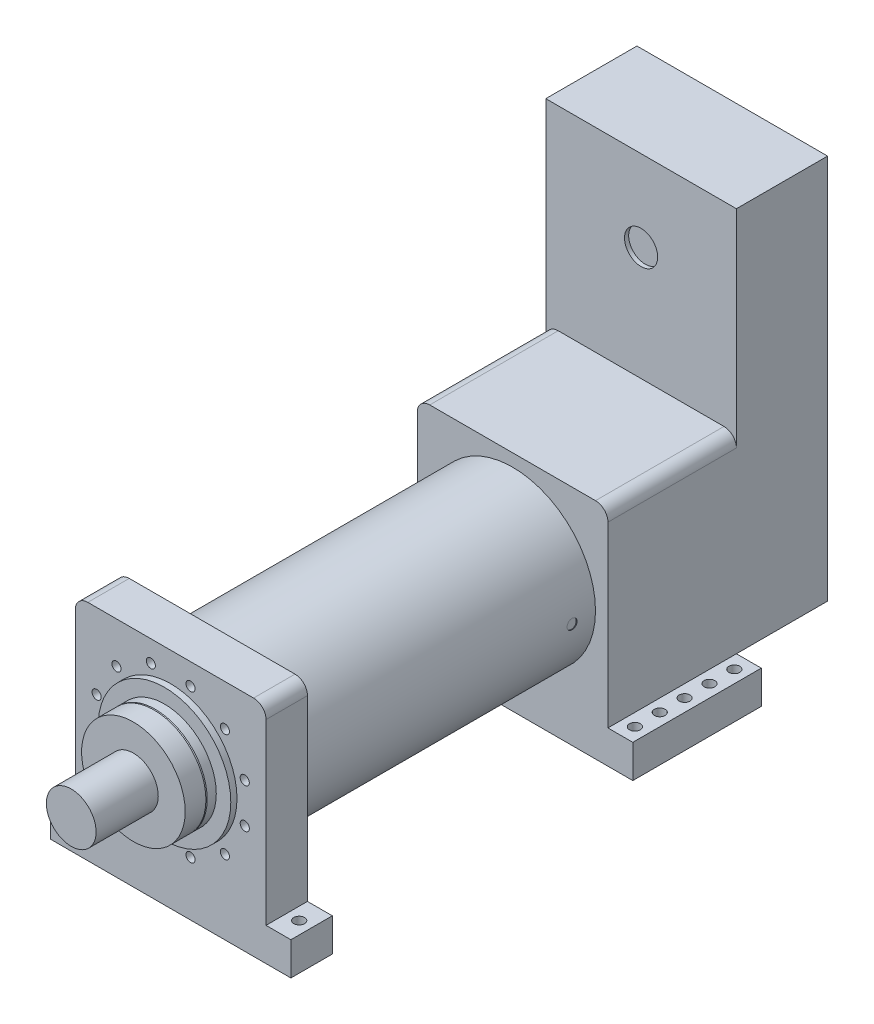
from build123d import *

# Parameters (mm, degrees)
SKETCH_1_R          = 200
EXTRUDE_1_DEPTH     = 725
SKETCH_2_W          = 460
SKETCH_2_H          = 460
SKETCH_2_R          = 11
EXTRUDE_2_DEPTH     = 100
SKETCH_6_W          = 460
SKETCH_6_H          = 460
EXTRUDE_6_DEPTH     = 310
SKETCH_9_R          = 12
CUT_EXTRUDE_2_DEPTH = 2
SKETCH_10_R         = 12
CUT_EXTRUDE_3_DEPTH = 2
SKETCH_12_W         = 460
SKETCH_12_H         = 930
EXTRUDE_9_DEPTH     = 220
SKETCH_13_R         = 40
CUT_EXTRUDE_5_DEPTH = 10
SKETCH_18_W         = 580
SKETCH_18_H         = 310
SKETCH_18_R         = 13
EXTRUDE_16_DEPTH    = 80
SKETCH_19_R         = 160
EXTRUDE_17_DEPTH    = 15
SKETCH_20_R         = 125
EXTRUDE_18_DEPTH    = 25
CHAMFER_1_SIZE      = 3
CHAMFER_1_SIZE2     = 1.091910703
SKETCH_21_R         = 125
EXTRUDE_19_DEPTH    = 50
SKETCH_22_R         = 60
EXTRUDE_20_DEPTH    = 150
SKETCH_23_W         = 580
SKETCH_23_H         = 100
SKETCH_23_R         = 13
EXTRUDE_21_DEPTH    = 80
FILLET_2_R          = 30


with BuildPart() as part:
    # Sketch 1 → Extrude 1 (new body)
    with BuildSketch(Plane.XY):
        Circle(SKETCH_1_R)
    extrude(amount=EXTRUDE_1_DEPTH)

    # Sketch 2 → Extrude 2 (add)
    with BuildSketch(Plane.XY.offset(725)):
        Rectangle(SKETCH_2_W, SKETCH_2_H)
        with Locations((178.696277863, 47.881523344)):
            Circle(SKETCH_2_R, mode=Mode.SUBTRACT)
        with Locations((178.696277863, -47.881523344)):
            Circle(SKETCH_2_R, mode=Mode.SUBTRACT)
        with Locations((130.81475452, -130.81475452)):
            Circle(SKETCH_2_R, mode=Mode.SUBTRACT)
        with Locations((47.881523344, -178.696277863)):
            Circle(SKETCH_2_R, mode=Mode.SUBTRACT)
        with Locations((-47.881523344, -178.696277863)):
            Circle(SKETCH_2_R, mode=Mode.SUBTRACT)
        with Locations((-130.81475452, -130.81475452)):
            Circle(SKETCH_2_R, mode=Mode.SUBTRACT)
        with Locations((-178.696277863, -47.881523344)):
            Circle(SKETCH_2_R, mode=Mode.SUBTRACT)
        with Locations((-178.696277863, 47.881523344)):
            Circle(SKETCH_2_R, mode=Mode.SUBTRACT)
        with Locations((-130.81475452, 130.814754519)):
            Circle(SKETCH_2_R, mode=Mode.SUBTRACT)
        with Locations((-47.881523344, 178.696277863)):
            Circle(SKETCH_2_R, mode=Mode.SUBTRACT)
        with Locations((47.881523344, 178.696277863)):
            Circle(SKETCH_2_R, mode=Mode.SUBTRACT)
        with Locations((130.81475452, 130.81475452)):
            Circle(SKETCH_2_R, mode=Mode.SUBTRACT)
    extrude(amount=EXTRUDE_2_DEPTH)

    # Sketch 9 → Cut-Extrude 2 (cut)
    with BuildSketch(Plane(origin=(-200, 0, 0), x_dir=(0, 0, -1), z_dir=(1, 0, 0))):
        with Locations(Location((-36.5, 0, 0), (0, 0, 180))):
            Circle(SKETCH_9_R)
        with Locations(Location((-670.5, 0, 0), (0, 0, 180))):
            Circle(SKETCH_9_R)
    extrude(amount=CUT_EXTRUDE_2_DEPTH, mode=Mode.SUBTRACT)

    # Sketch 10 → Cut-Extrude 3 (cut)
    with BuildSketch(Plane(origin=(200, 0, 0), x_dir=(0, 0, -1), z_dir=(1, 0, 0))):
        with Locations((-56.5, 0)):
            Circle(SKETCH_10_R)
    extrude(amount=-CUT_EXTRUDE_3_DEPTH, mode=Mode.SUBTRACT)


with BuildPart() as body_2:
    # Sketch 6 → Extrude 6 (new body)
    with BuildSketch(Plane(origin=(0, 0, 0), x_dir=(-1, 0, 0), z_dir=(0, 0, -1))):
        Rectangle(SKETCH_6_W, SKETCH_6_H)
    extrude(amount=EXTRUDE_6_DEPTH)


    add(part.part)  # Extrude 16 merges part


with BuildPart() as body_3:
    # Sketch 12 → Extrude 9 (new body)
    with BuildSketch(Plane(origin=(0, 0, -310), x_dir=(-1, 0, 0), z_dir=(0, 0, -1))):
        with Locations((0, 235)):
            Rectangle(SKETCH_12_W, SKETCH_12_H)
    extrude(amount=EXTRUDE_9_DEPTH)

    # Sketch 13 → Cut-Extrude 5 (cut)
    with BuildSketch(Plane.XY.offset(-310)):
        with Locations((0, 504)):
            Circle(SKETCH_13_R)
    extrude(amount=-CUT_EXTRUDE_5_DEPTH, mode=Mode.SUBTRACT)


with BuildPart() as body_2_1:
    add(body_2.part)

    add(body_3.part)  # Extrude 16 merges body 3
    # Sketch 18 → Extrude 16 (add)
    with BuildSketch(Plane.XZ.offset(230)):
        with Locations((0, -155)):
            Rectangle(SKETCH_18_W, SKETCH_18_H)
        with Locations(Location((-260, -275, 0), (0, 0, 270))):
            Circle(SKETCH_18_R, mode=Mode.SUBTRACT)
        with Locations(Location((-260, -215, 0), (0, 0, 270))):
            Circle(SKETCH_18_R, mode=Mode.SUBTRACT)
        with Locations(Location((-260, -155, 0), (0, 0, 270))):
            Circle(SKETCH_18_R, mode=Mode.SUBTRACT)
        with Locations(Location((-260, -95, 0), (0, 0, 270))):
            Circle(SKETCH_18_R, mode=Mode.SUBTRACT)
        with Locations(Location((-260, -35, 0), (0, 0, 270))):
            Circle(SKETCH_18_R, mode=Mode.SUBTRACT)
        with Locations(Location((260, -35, 0), (0, 0, 90))):
            Circle(SKETCH_18_R, mode=Mode.SUBTRACT)
        with Locations(Location((260, -95, 0), (0, 0, 90))):
            Circle(SKETCH_18_R, mode=Mode.SUBTRACT)
        with Locations(Location((260, -155, 0), (0, 0, 90))):
            Circle(SKETCH_18_R, mode=Mode.SUBTRACT)
        with Locations(Location((260, -215, 0), (0, 0, 90))):
            Circle(SKETCH_18_R, mode=Mode.SUBTRACT)
        with Locations(Location((260, -275, 0), (0, 0, 90))):
            Circle(SKETCH_18_R, mode=Mode.SUBTRACT)
    extrude(amount=EXTRUDE_16_DEPTH)

    # Sketch 19 → Extrude 17 (add)
    with BuildSketch(Plane.XY.offset(825)):
        Circle(SKETCH_19_R)
    extrude(amount=EXTRUDE_17_DEPTH)

    # Sketch 23 → Extrude 21 (add)
    with BuildSketch(Plane.XZ.offset(230)):
        with Locations((0, 775)):
            Rectangle(SKETCH_23_W, SKETCH_23_H)
        with Locations(Location((-260, 775, 0), (0, 0, 270))):
            Circle(SKETCH_23_R, mode=Mode.SUBTRACT)
        with Locations(Location((260, 775, 0), (0, 0, 270))):
            Circle(SKETCH_23_R, mode=Mode.SUBTRACT)
    extrude(amount=EXTRUDE_21_DEPTH)

    # Fillet 2
    fillet_2_edges = [body_2_1.edges().sort_by_distance(p)[0] for p in [
        (230, 230, 775),
        (-230, 230, 775),
        (230, 230, -155),
        (-230, 230, -155),
    ]]
    fillet(fillet_2_edges, radius=FILLET_2_R)


with BuildPart() as body_2_2:
    # Sketch 20 → Extrude 18 (new body)
    with BuildSketch(Plane.XY.offset(840)):
        Circle(SKETCH_20_R)
    extrude(amount=EXTRUDE_18_DEPTH)

    # Chamfer 1
    chamfer_1_edges = [body_2_2.edges().sort_by_distance(p)[0] for p in [
        (-125, 0, 865),
    ]]
    chamfer_1_side = [body_2_2.faces().sort_by_distance(p)[0] for p in [
        (-125, 0, 852.5),
    ]]
    chamfer(chamfer_1_edges, length=CHAMFER_1_SIZE, length2=CHAMFER_1_SIZE2, reference=chamfer_1_side[0])


with BuildPart() as body_3_2:
    # Sketch 21 → Extrude 19 (new body)
    with BuildSketch(Plane.XY.offset(865)):
        Circle(SKETCH_21_R)
    extrude(amount=EXTRUDE_19_DEPTH)


with BuildPart() as body_4:
    # Sketch 22 → Extrude 20 (new body)
    with BuildSketch(Plane.XY.offset(915)):
        Circle(SKETCH_22_R)
    extrude(amount=EXTRUDE_20_DEPTH)


solid = Compound([body_2_1.part, body_2_2.part, body_3_2.part, body_4.part])
